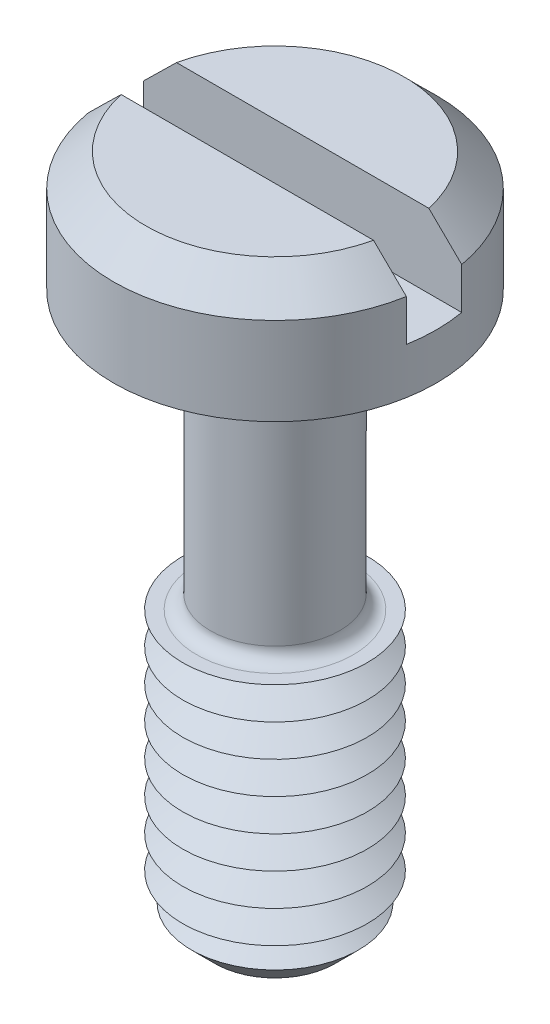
from build123d import *

# Parameters (mm, degrees)
SKETCH1_R           = 3.5
BOSS_EXTRUDE1_DEPTH = 2.6
SKETCH2_R           = 1.4
BOSS_EXTRUDE2_DEPTH = 12
SKETCH3_R           = 2
BOSS_EXTRUDE3_DEPTH = 6
CHAMFER1_SIZE       = 0.7
LPATTERN1_COUNT     = 8
LPATTERN1_PITCH     = 0.7
FILLET1_R           = 0.3
CHAMFER2_SIZE       = 0.7
SKETCH6_W           = 7
SKETCH6_H           = 1.2
CUT_EXTRUDE1_DEPTH  = 1.6


with BuildPart() as part:
    # Sketch1 → Boss-Extrude1 (new body)
    with BuildSketch(Plane(origin=(0, 0, 0), x_dir=(1, 0, 0), z_dir=(0, 1, 0))):
        with Locations(Location((0, 0, 0), (0, 0, 270))):
            Circle(SKETCH1_R)
    extrude(amount=BOSS_EXTRUDE1_DEPTH)

    # Sketch2 → Boss-Extrude2 (add)
    with BuildSketch(Plane.XZ):
        with Locations(Location((0, 0, 0), (0, 0, 270))):
            Circle(SKETCH2_R)
    extrude(amount=BOSS_EXTRUDE2_DEPTH)

    # Sketch3 → Boss-Extrude3 (add)
    with BuildSketch(Plane.XZ.offset(12)):
        with Locations(Location((0, 0, 0), (0, 0, 270))):
            Circle(SKETCH3_R)
    extrude(amount=-BOSS_EXTRUDE3_DEPTH)

    # Chamfer1
    chamfer1_edges = [part.edges().sort_by_distance(p)[0] for p in [
        (0, -12, 2),
    ]]
    chamfer(chamfer1_edges, length=CHAMFER1_SIZE)

    # Sketch5 → Cut-Revolve1 (revolve, cut)
    with BuildSketch(Plane(origin=(0, 0, 0), x_dir=(0, 0, -1), z_dir=(1, 0, 0))):
        Polygon((-2, -6), (-1.393782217, -6.35), (-2, -6.7), align=None)
    cut_revolve1 = revolve(axis=Axis((0, -6.58711856, 0), (0, -1, 0)), mode=Mode.SUBTRACT)

    # LPattern1: Cut-Revolve1 ×8
    with Locations(*[(0, -i * LPATTERN1_PITCH, 0) for i in range(1, LPATTERN1_COUNT)]):
        add(cut_revolve1, mode=Mode.SUBTRACT)

    # Fillet1
    fillet1_edges = [part.edges().sort_by_distance(p)[0] for p in [
        (0, 0, 1.4),
        (0, -6, 1.4),
    ]]
    fillet(fillet1_edges, radius=FILLET1_R)

    # Chamfer2
    chamfer2_edges = [part.edges().sort_by_distance(p)[0] for p in [
        (0, 2.6, -3.5),
    ]]
    chamfer(chamfer2_edges, length=CHAMFER2_SIZE)

    # Sketch6 → Cut-Extrude1 (cut)
    with BuildSketch(Plane(origin=(0, 2.6, 0), x_dir=(1, 0, 0), z_dir=(0, 1, 0))):
        Rectangle(SKETCH6_W, SKETCH6_H)
    extrude(amount=-CUT_EXTRUDE1_DEPTH, mode=Mode.SUBTRACT)


solid = part.part
